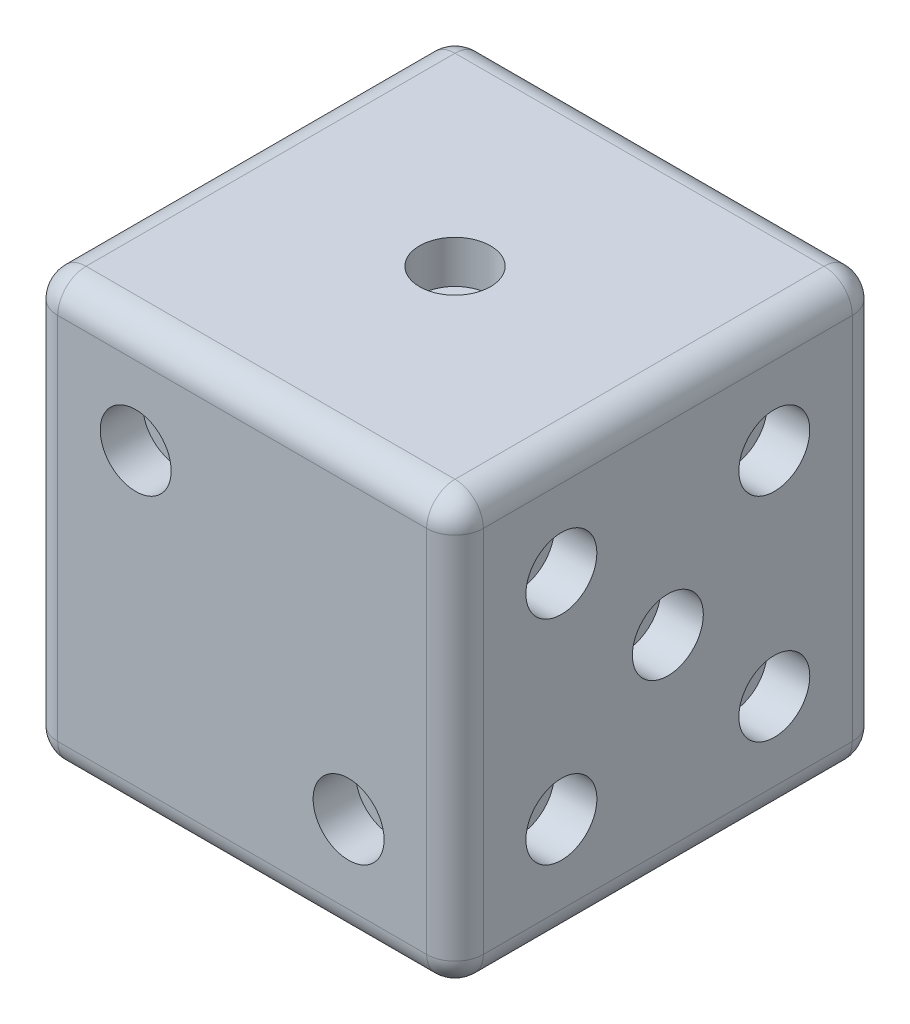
ISO-10303-21;
HEADER;
FILE_DESCRIPTION(('STEP AP214'),'2;1');
FILE_NAME('part.step','',(''),(''),'','','');
FILE_SCHEMA(('AUTOMOTIVE_DESIGN { 1 0 10303 214 1 1 1 1 }'));
ENDSEC;
DATA;
#1=APPLICATION_CONTEXT('core data for automotive mechanical design processes');
#2=APPLICATION_PROTOCOL_DEFINITION('international standard','automotive_design',2000,#1);
#3=PRODUCT_CONTEXT('',#1,'mechanical');
#4=PRODUCT('Part','Part','',(#3));
#5=PRODUCT_RELATED_PRODUCT_CATEGORY('part','',(#4));
#6=PRODUCT_DEFINITION_FORMATION('','',#4);
#7=PRODUCT_DEFINITION_CONTEXT('part definition',#1,'design');
#8=PRODUCT_DEFINITION('design','',#6,#7);
#9=PRODUCT_DEFINITION_SHAPE('','',#8);
#10=(LENGTH_UNIT() NAMED_UNIT(*) SI_UNIT(.MILLI.,.METRE.));
#11=(NAMED_UNIT(*) PLANE_ANGLE_UNIT() SI_UNIT($,.RADIAN.));
#12=(NAMED_UNIT(*) SI_UNIT($,.STERADIAN.) SOLID_ANGLE_UNIT());
#13=UNCERTAINTY_MEASURE_WITH_UNIT(LENGTH_MEASURE(1.E-05),#10,'distance_accuracy_value','');
#14=(GEOMETRIC_REPRESENTATION_CONTEXT(3) GLOBAL_UNCERTAINTY_ASSIGNED_CONTEXT((#13)) GLOBAL_UNIT_ASSIGNED_CONTEXT((#10,
#11,#12)) REPRESENTATION_CONTEXT('',''));
#15=CARTESIAN_POINT('',(0.,0.,0.));
#16=DIRECTION('',(0.,0.,1.));
#17=DIRECTION('',(1.,0.,0.));
#18=AXIS2_PLACEMENT_3D('',#15,#16,#17);
#19=CARTESIAN_POINT('',(30.,30.,0.));
#20=DIRECTION('',(-1.,0.,0.));
#21=DIRECTION('',(0.,0.,1.));
#22=AXIS2_PLACEMENT_3D('',#19,#20,#21);
#23=PLANE('',#22);
#24=CARTESIAN_POINT('',(30.,22.5024029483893,-22.5024029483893));
#25=DIRECTION('',(-1.,0.,0.));
#26=DIRECTION('',(0.,0.,1.));
#27=AXIS2_PLACEMENT_3D('',#24,#25,#26);
#28=CIRCLE('',#27,2.5);
#29=CARTESIAN_POINT('',(30.,22.5024029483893,-20.0024029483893));
#30=VERTEX_POINT('',#29);
#31=EDGE_CURVE('E1109',#30,#30,#28,.T.);
#32=ORIENTED_EDGE('',*,*,#31,.T.);
#33=EDGE_LOOP('',(#32));
#34=FACE_BOUND('',#33,.T.);
#35=DIRECTION('',(0.,-1.,0.));
#36=VECTOR('',#35,1.);
#37=CARTESIAN_POINT('',(30.,30.,-2.));
#38=LINE('',#37,#36);
#39=CARTESIAN_POINT('',(30.,28.,-2.));
#40=VERTEX_POINT('',#39);
#41=CARTESIAN_POINT('',(30.,2.,-2.));
#42=VERTEX_POINT('',#41);
#43=EDGE_CURVE('E191',#40,#42,#38,.T.);
#44=ORIENTED_EDGE('',*,*,#43,.T.);
#45=DIRECTION('',(0.,0.,-1.));
#46=VECTOR('',#45,1.);
#47=CARTESIAN_POINT('',(30.,2.,-28.));
#48=LINE('',#47,#46);
#49=CARTESIAN_POINT('',(30.,2.,-28.));
#50=VERTEX_POINT('',#49);
#51=EDGE_CURVE('E236',#42,#50,#48,.T.);
#52=ORIENTED_EDGE('',*,*,#51,.T.);
#53=DIRECTION('',(0.,-1.,0.));
#54=VECTOR('',#53,1.);
#55=CARTESIAN_POINT('',(30.,30.,-28.));
#56=LINE('',#55,#54);
#57=CARTESIAN_POINT('',(30.,28.,-28.));
#58=VERTEX_POINT('',#57);
#59=EDGE_CURVE('E187',#50,#58,#56,.F.);
#60=ORIENTED_EDGE('',*,*,#59,.T.);
#61=DIRECTION('',(0.,0.,-1.));
#62=VECTOR('',#61,1.);
#63=CARTESIAN_POINT('',(30.,28.,0.));
#64=LINE('',#63,#62);
#65=EDGE_CURVE('E189',#58,#40,#64,.F.);
#66=ORIENTED_EDGE('',*,*,#65,.T.);
#67=EDGE_LOOP('',(#44,#52,#60,#66));
#68=FACE_BOUND('',#67,.T.);
#69=CARTESIAN_POINT('',(30.,7.49759705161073,-22.5024029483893));
#70=DIRECTION('',(1.,0.,0.));
#71=DIRECTION('',(0.,0.,-1.));
#72=AXIS2_PLACEMENT_3D('',#69,#70,#71);
#73=CIRCLE('',#72,2.5);
#74=CARTESIAN_POINT('',(30.,7.49759705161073,-25.0024029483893));
#75=VERTEX_POINT('',#74);
#76=EDGE_CURVE('E1111',#75,#75,#73,.T.);
#77=ORIENTED_EDGE('',*,*,#76,.F.);
#78=EDGE_LOOP('',(#77));
#79=FACE_BOUND('',#78,.T.);
#80=CARTESIAN_POINT('',(30.,22.5024029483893,-7.49759705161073));
#81=DIRECTION('',(1.,0.,0.));
#82=DIRECTION('',(0.,0.,-1.));
#83=AXIS2_PLACEMENT_3D('',#80,#81,#82);
#84=CIRCLE('',#83,2.5);
#85=CARTESIAN_POINT('',(30.,22.5024029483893,-9.99759705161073));
#86=VERTEX_POINT('',#85);
#87=EDGE_CURVE('E1117',#86,#86,#84,.T.);
#88=ORIENTED_EDGE('',*,*,#87,.F.);
#89=EDGE_LOOP('',(#88));
#90=FACE_BOUND('',#89,.T.);
#91=CARTESIAN_POINT('',(30.,15.,-15.));
#92=DIRECTION('',(1.,0.,0.));
#93=DIRECTION('',(0.,0.,-1.));
#94=AXIS2_PLACEMENT_3D('',#91,#92,#93);
#95=CIRCLE('',#94,2.5);
#96=CARTESIAN_POINT('',(30.,15.,-17.5));
#97=VERTEX_POINT('',#96);
#98=EDGE_CURVE('E1123',#97,#97,#95,.T.);
#99=ORIENTED_EDGE('',*,*,#98,.F.);
#100=EDGE_LOOP('',(#99));
#101=FACE_BOUND('',#100,.T.);
#102=CARTESIAN_POINT('',(30.,7.49759705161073,-7.49759705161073));
#103=DIRECTION('',(-1.,0.,0.));
#104=DIRECTION('',(0.,0.,1.));
#105=AXIS2_PLACEMENT_3D('',#102,#103,#104);
#106=CIRCLE('',#105,2.5);
#107=CARTESIAN_POINT('',(30.,7.49759705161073,-4.99759705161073));
#108=VERTEX_POINT('',#107);
#109=EDGE_CURVE('E1129',#108,#108,#106,.T.);
#110=ORIENTED_EDGE('',*,*,#109,.T.);
#111=EDGE_LOOP('',(#110));
#112=FACE_BOUND('',#111,.T.);
#113=ADVANCED_FACE('F35',(#34,#68,#79,#90,#101,#112),#23,.F.);
#114=CARTESIAN_POINT('',(0.,30.,0.));
#115=DIRECTION('',(-1.,0.,0.));
#116=DIRECTION('',(0.,0.,1.));
#117=AXIS2_PLACEMENT_3D('',#114,#115,#116);
#118=PLANE('',#117);
#119=CARTESIAN_POINT('',(0.,22.5024029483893,-7.49759705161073));
#120=DIRECTION('',(1.,0.,0.));
#121=DIRECTION('',(0.,0.,-1.));
#122=AXIS2_PLACEMENT_3D('',#119,#120,#121);
#123=CIRCLE('',#122,2.5);
#124=CARTESIAN_POINT('',(0.,22.5024029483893,-9.99759705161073));
#125=VERTEX_POINT('',#124);
#126=EDGE_CURVE('E995',#125,#125,#123,.T.);
#127=ORIENTED_EDGE('',*,*,#126,.T.);
#128=EDGE_LOOP('',(#127));
#129=FACE_BOUND('',#128,.T.);
#130=CARTESIAN_POINT('',(0.,22.5024029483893,-22.5024029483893));
#131=DIRECTION('',(-1.,0.,0.));
#132=DIRECTION('',(0.,0.,1.));
#133=AXIS2_PLACEMENT_3D('',#130,#131,#132);
#134=CIRCLE('',#133,2.5);
#135=CARTESIAN_POINT('',(0.,22.5024029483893,-20.0024029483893));
#136=VERTEX_POINT('',#135);
#137=EDGE_CURVE('E998',#136,#136,#134,.T.);
#138=ORIENTED_EDGE('',*,*,#137,.F.);
#139=EDGE_LOOP('',(#138));
#140=FACE_BOUND('',#139,.T.);
#141=DIRECTION('',(0.,-1.,0.));
#142=VECTOR('',#141,1.);
#143=CARTESIAN_POINT('',(0.,30.,-28.));
#144=LINE('',#143,#142);
#145=CARTESIAN_POINT('',(0.,28.,-28.));
#146=VERTEX_POINT('',#145);
#147=CARTESIAN_POINT('',(0.,2.,-28.));
#148=VERTEX_POINT('',#147);
#149=EDGE_CURVE('E161',#146,#148,#144,.T.);
#150=ORIENTED_EDGE('',*,*,#149,.T.);
#151=DIRECTION('',(0.,0.,-1.));
#152=VECTOR('',#151,1.);
#153=CARTESIAN_POINT('',(0.,2.,0.));
#154=LINE('',#153,#152);
#155=CARTESIAN_POINT('',(0.,2.,-2.));
#156=VERTEX_POINT('',#155);
#157=EDGE_CURVE('E11',#148,#156,#154,.F.);
#158=ORIENTED_EDGE('',*,*,#157,.T.);
#159=DIRECTION('',(0.,-1.,0.));
#160=VECTOR('',#159,1.);
#161=CARTESIAN_POINT('',(0.,30.,-2.));
#162=LINE('',#161,#160);
#163=CARTESIAN_POINT('',(0.,28.,-2.));
#164=VERTEX_POINT('',#163);
#165=EDGE_CURVE('E123',#156,#164,#162,.F.);
#166=ORIENTED_EDGE('',*,*,#165,.T.);
#167=DIRECTION('',(0.,0.,-1.));
#168=VECTOR('',#167,1.);
#169=CARTESIAN_POINT('',(0.,28.,-30.));
#170=LINE('',#169,#168);
#171=EDGE_CURVE('E129',#164,#146,#170,.T.);
#172=ORIENTED_EDGE('',*,*,#171,.T.);
#173=EDGE_LOOP('',(#150,#158,#166,#172));
#174=FACE_BOUND('',#173,.T.);
#175=CARTESIAN_POINT('',(0.,7.49759705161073,-7.49759705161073));
#176=DIRECTION('',(-1.,0.,0.));
#177=DIRECTION('',(0.,0.,1.));
#178=AXIS2_PLACEMENT_3D('',#175,#176,#177);
#179=CIRCLE('',#178,2.5);
#180=CARTESIAN_POINT('',(0.,7.49759705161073,-4.99759705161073));
#181=VERTEX_POINT('',#180);
#182=EDGE_CURVE('E989',#181,#181,#179,.T.);
#183=ORIENTED_EDGE('',*,*,#182,.F.);
#184=EDGE_LOOP('',(#183));
#185=FACE_BOUND('',#184,.T.);
#186=CARTESIAN_POINT('',(0.,7.49759705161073,-22.5024029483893));
#187=DIRECTION('',(1.,0.,0.));
#188=DIRECTION('',(0.,0.,-1.));
#189=AXIS2_PLACEMENT_3D('',#186,#187,#188);
#190=CIRCLE('',#189,2.5);
#191=CARTESIAN_POINT('',(0.,7.49759705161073,-25.0024029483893));
#192=VERTEX_POINT('',#191);
#193=EDGE_CURVE('E983',#192,#192,#190,.T.);
#194=ORIENTED_EDGE('',*,*,#193,.T.);
#195=EDGE_LOOP('',(#194));
#196=FACE_BOUND('',#195,.T.);
#197=ADVANCED_FACE('F126',(#129,#140,#174,#185,#196),#118,.T.);
#198=CARTESIAN_POINT('',(0.,0.,0.));
#199=DIRECTION('',(0.,-1.,0.));
#200=DIRECTION('',(0.,0.,-1.));
#201=AXIS2_PLACEMENT_3D('',#198,#199,#200);
#202=PLANE('',#201);
#203=DIRECTION('',(0.,0.,-1.));
#204=VECTOR('',#203,1.);
#205=CARTESIAN_POINT('',(2.,0.,0.));
#206=LINE('',#205,#204);
#207=CARTESIAN_POINT('',(2.,0.,-2.));
#208=VERTEX_POINT('',#207);
#209=CARTESIAN_POINT('',(1.99999999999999,0.,-28.));
#210=VERTEX_POINT('',#209);
#211=EDGE_CURVE('E227',#208,#210,#206,.T.);
#212=ORIENTED_EDGE('',*,*,#211,.T.);
#213=DIRECTION('',(1.,0.,0.));
#214=VECTOR('',#213,1.);
#215=CARTESIAN_POINT('',(0.,0.,-28.));
#216=LINE('',#215,#214);
#217=CARTESIAN_POINT('',(28.,0.,-28.));
#218=VERTEX_POINT('',#217);
#219=EDGE_CURVE('E232',#210,#218,#216,.T.);
#220=ORIENTED_EDGE('',*,*,#219,.T.);
#221=DIRECTION('',(0.,0.,-1.));
#222=VECTOR('',#221,1.);
#223=CARTESIAN_POINT('',(28.,0.,-2.));
#224=LINE('',#223,#222);
#225=CARTESIAN_POINT('',(28.,0.,-2.));
#226=VERTEX_POINT('',#225);
#227=EDGE_CURVE('E52',#218,#226,#224,.F.);
#228=ORIENTED_EDGE('',*,*,#227,.T.);
#229=DIRECTION('',(1.,0.,0.));
#230=VECTOR('',#229,1.);
#231=CARTESIAN_POINT('',(2.,0.,-2.));
#232=LINE('',#231,#230);
#233=EDGE_CURVE('E229',#226,#208,#232,.F.);
#234=ORIENTED_EDGE('',*,*,#233,.T.);
#235=EDGE_LOOP('',(#212,#220,#228,#234));
#236=FACE_BOUND('',#235,.T.);
#237=CARTESIAN_POINT('',(22.5,0.,-22.5));
#238=DIRECTION('',(0.,-1.,0.));
#239=DIRECTION('',(0.,0.,-1.));
#240=AXIS2_PLACEMENT_3D('',#237,#238,#239);
#241=CIRCLE('',#240,2.5);
#242=CARTESIAN_POINT('',(22.5,0.,-25.));
#243=VERTEX_POINT('',#242);
#244=EDGE_CURVE('E1025',#243,#243,#241,.T.);
#245=ORIENTED_EDGE('',*,*,#244,.F.);
#246=EDGE_LOOP('',(#245));
#247=FACE_BOUND('',#246,.T.);
#248=CARTESIAN_POINT('',(22.5,0.,-15.));
#249=DIRECTION('',(0.,-1.,0.));
#250=DIRECTION('',(0.,0.,-1.));
#251=AXIS2_PLACEMENT_3D('',#248,#249,#250);
#252=CIRCLE('',#251,2.5);
#253=CARTESIAN_POINT('',(22.5,0.,-17.5));
#254=VERTEX_POINT('',#253);
#255=EDGE_CURVE('E1031',#254,#254,#252,.T.);
#256=ORIENTED_EDGE('',*,*,#255,.F.);
#257=EDGE_LOOP('',(#256));
#258=FACE_BOUND('',#257,.T.);
#259=CARTESIAN_POINT('',(7.5,0.,-15.));
#260=DIRECTION('',(0.,1.,0.));
#261=DIRECTION('',(0.,0.,1.));
#262=AXIS2_PLACEMENT_3D('',#259,#260,#261);
#263=CIRCLE('',#262,2.5);
#264=CARTESIAN_POINT('',(7.5,0.,-12.5));
#265=VERTEX_POINT('',#264);
#266=EDGE_CURVE('E1049',#265,#265,#263,.T.);
#267=ORIENTED_EDGE('',*,*,#266,.T.);
#268=EDGE_LOOP('',(#267));
#269=FACE_BOUND('',#268,.T.);
#270=CARTESIAN_POINT('',(7.5,0.,-22.5));
#271=DIRECTION('',(0.,1.,0.));
#272=DIRECTION('',(0.,0.,1.));
#273=AXIS2_PLACEMENT_3D('',#270,#271,#272);
#274=CIRCLE('',#273,2.5);
#275=CARTESIAN_POINT('',(7.5,0.,-20.));
#276=VERTEX_POINT('',#275);
#277=EDGE_CURVE('E1052',#276,#276,#274,.T.);
#278=ORIENTED_EDGE('',*,*,#277,.T.);
#279=EDGE_LOOP('',(#278));
#280=FACE_BOUND('',#279,.T.);
#281=CARTESIAN_POINT('',(7.5,0.,-7.50000000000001));
#282=DIRECTION('',(0.,-1.,0.));
#283=DIRECTION('',(0.,0.,-1.));
#284=AXIS2_PLACEMENT_3D('',#281,#282,#283);
#285=CIRCLE('',#284,2.5);
#286=CARTESIAN_POINT('',(7.5,0.,-10.));
#287=VERTEX_POINT('',#286);
#288=EDGE_CURVE('E1043',#287,#287,#285,.T.);
#289=ORIENTED_EDGE('',*,*,#288,.F.);
#290=EDGE_LOOP('',(#289));
#291=FACE_BOUND('',#290,.T.);
#292=CARTESIAN_POINT('',(22.5,0.,-7.50000000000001));
#293=DIRECTION('',(0.,1.,0.));
#294=DIRECTION('',(0.,0.,1.));
#295=AXIS2_PLACEMENT_3D('',#292,#293,#294);
#296=CIRCLE('',#295,2.5);
#297=CARTESIAN_POINT('',(22.5,0.,-5.00000000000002));
#298=VERTEX_POINT('',#297);
#299=EDGE_CURVE('E1037',#298,#298,#296,.T.);
#300=ORIENTED_EDGE('',*,*,#299,.T.);
#301=EDGE_LOOP('',(#300));
#302=FACE_BOUND('',#301,.T.);
#303=ADVANCED_FACE('F330',(#236,#247,#258,#269,#280,#291,#302),#202,.T.);
#304=CARTESIAN_POINT('',(0.,30.,0.));
#305=DIRECTION('',(0.,0.,-1.));
#306=DIRECTION('',(-1.,0.,0.));
#307=AXIS2_PLACEMENT_3D('',#304,#305,#306);
#308=PLANE('',#307);
#309=CARTESIAN_POINT('',(22.5024029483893,7.49759705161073,0.));
#310=DIRECTION('',(0.,0.,1.));
#311=DIRECTION('',(1.,0.,0.));
#312=AXIS2_PLACEMENT_3D('',#309,#310,#311);
#313=CIRCLE('',#312,2.5);
#314=CARTESIAN_POINT('',(25.0024029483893,7.49759705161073,0.));
#315=VERTEX_POINT('',#314);
#316=EDGE_CURVE('E969',#315,#315,#313,.T.);
#317=ORIENTED_EDGE('',*,*,#316,.F.);
#318=EDGE_LOOP('',(#317));
#319=FACE_BOUND('',#318,.T.);
#320=CARTESIAN_POINT('',(7.49759705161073,22.5024029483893,0.));
#321=DIRECTION('',(0.,0.,1.));
#322=DIRECTION('',(1.,0.,0.));
#323=AXIS2_PLACEMENT_3D('',#320,#321,#322);
#324=CIRCLE('',#323,2.5);
#325=CARTESIAN_POINT('',(9.99759705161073,22.5024029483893,0.));
#326=VERTEX_POINT('',#325);
#327=EDGE_CURVE('E972',#326,#326,#324,.T.);
#328=ORIENTED_EDGE('',*,*,#327,.F.);
#329=EDGE_LOOP('',(#328));
#330=FACE_BOUND('',#329,.T.);
#331=DIRECTION('',(0.,-1.,0.));
#332=VECTOR('',#331,1.);
#333=CARTESIAN_POINT('',(2.,0.,0.));
#334=LINE('',#333,#332);
#335=CARTESIAN_POINT('',(2.,28.,0.));
#336=VERTEX_POINT('',#335);
#337=CARTESIAN_POINT('',(2.,2.,0.));
#338=VERTEX_POINT('',#337);
#339=EDGE_CURVE('E143',#336,#338,#334,.T.);
#340=ORIENTED_EDGE('',*,*,#339,.T.);
#341=DIRECTION('',(1.,0.,0.));
#342=VECTOR('',#341,1.);
#343=CARTESIAN_POINT('',(28.,2.,0.));
#344=LINE('',#343,#342);
#345=CARTESIAN_POINT('',(28.,2.,0.));
#346=VERTEX_POINT('',#345);
#347=EDGE_CURVE('E44',#338,#346,#344,.T.);
#348=ORIENTED_EDGE('',*,*,#347,.T.);
#349=DIRECTION('',(0.,-1.,0.));
#350=VECTOR('',#349,1.);
#351=CARTESIAN_POINT('',(28.,30.,0.));
#352=LINE('',#351,#350);
#353=CARTESIAN_POINT('',(28.,28.,0.));
#354=VERTEX_POINT('',#353);
#355=EDGE_CURVE('E182',#346,#354,#352,.F.);
#356=ORIENTED_EDGE('',*,*,#355,.T.);
#357=DIRECTION('',(1.,0.,0.));
#358=VECTOR('',#357,1.);
#359=CARTESIAN_POINT('',(0.,28.,0.));
#360=LINE('',#359,#358);
#361=EDGE_CURVE('E184',#354,#336,#360,.F.);
#362=ORIENTED_EDGE('',*,*,#361,.T.);
#363=EDGE_LOOP('',(#340,#348,#356,#362));
#364=FACE_BOUND('',#363,.T.);
#365=ADVANCED_FACE('F298',(#319,#330,#364),#308,.F.);
#366=CARTESIAN_POINT('',(0.,30.,-30.));
#367=DIRECTION('',(0.,0.,-1.));
#368=DIRECTION('',(-1.,0.,0.));
#369=AXIS2_PLACEMENT_3D('',#366,#367,#368);
#370=PLANE('',#369);
#371=CARTESIAN_POINT('',(7.49759705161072,22.5024029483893,-30.));
#372=DIRECTION('',(0.,0.,-1.));
#373=DIRECTION('',(-1.,0.,0.));
#374=AXIS2_PLACEMENT_3D('',#371,#372,#373);
#375=CIRCLE('',#374,2.5);
#376=CARTESIAN_POINT('',(4.99759705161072,22.5024029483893,-30.));
#377=VERTEX_POINT('',#376);
#378=EDGE_CURVE('E1007',#377,#377,#375,.T.);
#379=ORIENTED_EDGE('',*,*,#378,.F.);
#380=EDGE_LOOP('',(#379));
#381=FACE_BOUND('',#380,.T.);
#382=CARTESIAN_POINT('',(15.,15.,-30.));
#383=DIRECTION('',(0.,0.,-1.));
#384=DIRECTION('',(-1.,0.,0.));
#385=AXIS2_PLACEMENT_3D('',#382,#383,#384);
#386=CIRCLE('',#385,2.5);
#387=CARTESIAN_POINT('',(12.5,15.,-30.));
#388=VERTEX_POINT('',#387);
#389=EDGE_CURVE('E1013',#388,#388,#386,.T.);
#390=ORIENTED_EDGE('',*,*,#389,.F.);
#391=EDGE_LOOP('',(#390));
#392=FACE_BOUND('',#391,.T.);
#393=CARTESIAN_POINT('',(22.5024029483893,7.49759705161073,-30.));
#394=DIRECTION('',(0.,0.,-1.));
#395=DIRECTION('',(-1.,0.,0.));
#396=AXIS2_PLACEMENT_3D('',#393,#394,#395);
#397=CIRCLE('',#396,2.5);
#398=CARTESIAN_POINT('',(20.0024029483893,7.49759705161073,-30.));
#399=VERTEX_POINT('',#398);
#400=EDGE_CURVE('E1016',#399,#399,#397,.T.);
#401=ORIENTED_EDGE('',*,*,#400,.F.);
#402=EDGE_LOOP('',(#401));
#403=FACE_BOUND('',#402,.T.);
#404=DIRECTION('',(0.,-1.,0.));
#405=VECTOR('',#404,1.);
#406=CARTESIAN_POINT('',(28.,0.,-30.));
#407=LINE('',#406,#405);
#408=CARTESIAN_POINT('',(28.,28.,-30.));
#409=VERTEX_POINT('',#408);
#410=CARTESIAN_POINT('',(28.,2.,-30.));
#411=VERTEX_POINT('',#410);
#412=EDGE_CURVE('E163',#409,#411,#407,.T.);
#413=ORIENTED_EDGE('',*,*,#412,.T.);
#414=DIRECTION('',(1.,0.,0.));
#415=VECTOR('',#414,1.);
#416=CARTESIAN_POINT('',(0.,2.,-30.));
#417=LINE('',#416,#415);
#418=CARTESIAN_POINT('',(1.99999999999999,2.,-30.));
#419=VERTEX_POINT('',#418);
#420=EDGE_CURVE('E234',#411,#419,#417,.F.);
#421=ORIENTED_EDGE('',*,*,#420,.T.);
#422=DIRECTION('',(0.,-1.,0.));
#423=VECTOR('',#422,1.);
#424=CARTESIAN_POINT('',(1.99999999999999,30.,-30.));
#425=LINE('',#424,#423);
#426=CARTESIAN_POINT('',(1.99999999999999,28.,-30.));
#427=VERTEX_POINT('',#426);
#428=EDGE_CURVE('E171',#419,#427,#425,.F.);
#429=ORIENTED_EDGE('',*,*,#428,.T.);
#430=DIRECTION('',(1.,0.,0.));
#431=VECTOR('',#430,1.);
#432=CARTESIAN_POINT('',(30.,28.,-30.));
#433=LINE('',#432,#431);
#434=EDGE_CURVE('E169',#427,#409,#433,.T.);
#435=ORIENTED_EDGE('',*,*,#434,.T.);
#436=EDGE_LOOP('',(#413,#421,#429,#435));
#437=FACE_BOUND('',#436,.T.);
#438=ADVANCED_FACE('F271',(#381,#392,#403,#437),#370,.T.);
#439=CARTESIAN_POINT('',(0.,30.,0.));
#440=DIRECTION('',(0.,-1.,0.));
#441=DIRECTION('',(0.,0.,-1.));
#442=AXIS2_PLACEMENT_3D('',#439,#440,#441);
#443=PLANE('',#442);
#444=DIRECTION('',(1.,0.,0.));
#445=VECTOR('',#444,1.);
#446=CARTESIAN_POINT('',(0.,30.,-28.));
#447=LINE('',#446,#445);
#448=CARTESIAN_POINT('',(28.,30.,-28.));
#449=VERTEX_POINT('',#448);
#450=CARTESIAN_POINT('',(1.99999999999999,30.,-28.));
#451=VERTEX_POINT('',#450);
#452=EDGE_CURVE('E173',#449,#451,#447,.F.);
#453=ORIENTED_EDGE('',*,*,#452,.T.);
#454=DIRECTION('',(0.,0.,-1.));
#455=VECTOR('',#454,1.);
#456=CARTESIAN_POINT('',(2.,30.,0.));
#457=LINE('',#456,#455);
#458=CARTESIAN_POINT('',(2.,30.,-2.));
#459=VERTEX_POINT('',#458);
#460=EDGE_CURVE('E179',#451,#459,#457,.F.);
#461=ORIENTED_EDGE('',*,*,#460,.T.);
#462=DIRECTION('',(1.,0.,0.));
#463=VECTOR('',#462,1.);
#464=CARTESIAN_POINT('',(0.,30.,-2.));
#465=LINE('',#464,#463);
#466=CARTESIAN_POINT('',(28.,30.,-2.));
#467=VERTEX_POINT('',#466);
#468=EDGE_CURVE('E177',#459,#467,#465,.T.);
#469=ORIENTED_EDGE('',*,*,#468,.T.);
#470=DIRECTION('',(0.,0.,-1.));
#471=VECTOR('',#470,1.);
#472=CARTESIAN_POINT('',(28.,30.,0.));
#473=LINE('',#472,#471);
#474=EDGE_CURVE('E175',#467,#449,#473,.T.);
#475=ORIENTED_EDGE('',*,*,#474,.T.);
#476=EDGE_LOOP('',(#453,#461,#469,#475));
#477=FACE_BOUND('',#476,.T.);
#478=CARTESIAN_POINT('',(15.,30.,-15.));
#479=DIRECTION('',(0.,1.,0.));
#480=DIRECTION('',(0.,0.,1.));
#481=AXIS2_PLACEMENT_3D('',#478,#479,#480);
#482=CIRCLE('',#481,2.5);
#483=CARTESIAN_POINT('',(15.,30.,-12.5));
#484=VERTEX_POINT('',#483);
#485=EDGE_CURVE('E219',#484,#484,#482,.T.);
#486=ORIENTED_EDGE('',*,*,#485,.F.);
#487=EDGE_LOOP('',(#486));
#488=FACE_BOUND('',#487,.T.);
#489=ADVANCED_FACE('F307',(#477,#488),#443,.F.);
#490=CARTESIAN_POINT('',(7.5,3.,-22.5));
#491=DIRECTION('',(0.,-1.,0.));
#492=DIRECTION('',(0.,0.,-1.));
#493=AXIS2_PLACEMENT_3D('',#490,#491,#492);
#494=CYLINDRICAL_SURFACE('',#493,2.5);
#495=CARTESIAN_POINT('',(7.5,3.,-22.5));
#496=DIRECTION('',(0.,1.,0.));
#497=DIRECTION('',(0.,0.,1.));
#498=AXIS2_PLACEMENT_3D('',#495,#496,#497);
#499=CIRCLE('',#498,2.5);
#500=CARTESIAN_POINT('',(7.5,3.,-20.));
#501=VERTEX_POINT('',#500);
#502=EDGE_CURVE('E135',#501,#501,#499,.T.);
#503=ORIENTED_EDGE('',*,*,#502,.T.);
#504=EDGE_LOOP('',(#503));
#505=FACE_BOUND('',#504,.T.);
#506=ORIENTED_EDGE('',*,*,#277,.F.);
#507=EDGE_LOOP('',(#506));
#508=FACE_BOUND('',#507,.T.);
#509=ADVANCED_FACE('F880',(#505,#508),#494,.F.);
#510=CARTESIAN_POINT('',(7.5,3.,-22.5));
#511=DIRECTION('',(0.,1.,0.));
#512=DIRECTION('',(0.,0.,1.));
#513=AXIS2_PLACEMENT_3D('',#510,#511,#512);
#514=PLANE('',#513);
#515=ORIENTED_EDGE('',*,*,#502,.F.);
#516=EDGE_LOOP('',(#515));
#517=FACE_BOUND('',#516,.T.);
#518=ADVANCED_FACE('F871',(#517),#514,.F.);
#519=CARTESIAN_POINT('',(7.5,3.,-15.));
#520=DIRECTION('',(0.,-1.,0.));
#521=DIRECTION('',(0.,0.,-1.));
#522=AXIS2_PLACEMENT_3D('',#519,#520,#521);
#523=CYLINDRICAL_SURFACE('',#522,2.5);
#524=CARTESIAN_POINT('',(7.5,3.,-15.));
#525=DIRECTION('',(0.,1.,0.));
#526=DIRECTION('',(0.,0.,1.));
#527=AXIS2_PLACEMENT_3D('',#524,#525,#526);
#528=CIRCLE('',#527,2.5);
#529=CARTESIAN_POINT('',(7.5,3.,-12.5));
#530=VERTEX_POINT('',#529);
#531=EDGE_CURVE('E1046',#530,#530,#528,.T.);
#532=ORIENTED_EDGE('',*,*,#531,.T.);
#533=EDGE_LOOP('',(#532));
#534=FACE_BOUND('',#533,.T.);
#535=ORIENTED_EDGE('',*,*,#266,.F.);
#536=EDGE_LOOP('',(#535));
#537=FACE_BOUND('',#536,.T.);
#538=ADVANCED_FACE('F862',(#534,#537),#523,.F.);
#539=CARTESIAN_POINT('',(7.5,3.,-15.));
#540=DIRECTION('',(0.,1.,0.));
#541=DIRECTION('',(0.,0.,1.));
#542=AXIS2_PLACEMENT_3D('',#539,#540,#541);
#543=PLANE('',#542);
#544=ORIENTED_EDGE('',*,*,#531,.F.);
#545=EDGE_LOOP('',(#544));
#546=FACE_BOUND('',#545,.T.);
#547=ADVANCED_FACE('F853',(#546),#543,.F.);
#548=CARTESIAN_POINT('',(7.5,3.,-7.50000000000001));
#549=DIRECTION('',(0.,-1.,0.));
#550=DIRECTION('',(0.,0.,-1.));
#551=AXIS2_PLACEMENT_3D('',#548,#549,#550);
#552=CYLINDRICAL_SURFACE('',#551,2.5);
#553=CARTESIAN_POINT('',(7.5,3.,-7.50000000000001));
#554=DIRECTION('',(0.,-1.,0.));
#555=DIRECTION('',(0.,0.,-1.));
#556=AXIS2_PLACEMENT_3D('',#553,#554,#555);
#557=CIRCLE('',#556,2.5);
#558=CARTESIAN_POINT('',(7.5,3.,-10.));
#559=VERTEX_POINT('',#558);
#560=EDGE_CURVE('E1040',#559,#559,#557,.T.);
#561=ORIENTED_EDGE('',*,*,#560,.F.);
#562=EDGE_LOOP('',(#561));
#563=FACE_BOUND('',#562,.T.);
#564=ORIENTED_EDGE('',*,*,#288,.T.);
#565=EDGE_LOOP('',(#564));
#566=FACE_BOUND('',#565,.T.);
#567=ADVANCED_FACE('F844',(#563,#566),#552,.F.);
#568=CARTESIAN_POINT('',(7.5,3.,-7.50000000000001));
#569=DIRECTION('',(0.,-1.,0.));
#570=DIRECTION('',(0.,0.,-1.));
#571=AXIS2_PLACEMENT_3D('',#568,#569,#570);
#572=PLANE('',#571);
#573=ORIENTED_EDGE('',*,*,#560,.T.);
#574=EDGE_LOOP('',(#573));
#575=FACE_BOUND('',#574,.T.);
#576=ADVANCED_FACE('F835',(#575),#572,.T.);
#577=CARTESIAN_POINT('',(22.5,3.,-7.50000000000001));
#578=DIRECTION('',(0.,-1.,0.));
#579=DIRECTION('',(0.,0.,-1.));
#580=AXIS2_PLACEMENT_3D('',#577,#578,#579);
#581=CYLINDRICAL_SURFACE('',#580,2.5);
#582=CARTESIAN_POINT('',(22.5,3.,-7.50000000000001));
#583=DIRECTION('',(0.,1.,0.));
#584=DIRECTION('',(0.,0.,1.));
#585=AXIS2_PLACEMENT_3D('',#582,#583,#584);
#586=CIRCLE('',#585,2.5);
#587=CARTESIAN_POINT('',(22.5,3.,-5.00000000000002));
#588=VERTEX_POINT('',#587);
#589=EDGE_CURVE('E1034',#588,#588,#586,.T.);
#590=ORIENTED_EDGE('',*,*,#589,.T.);
#591=EDGE_LOOP('',(#590));
#592=FACE_BOUND('',#591,.T.);
#593=ORIENTED_EDGE('',*,*,#299,.F.);
#594=EDGE_LOOP('',(#593));
#595=FACE_BOUND('',#594,.T.);
#596=ADVANCED_FACE('F826',(#592,#595),#581,.F.);
#597=CARTESIAN_POINT('',(22.5,3.,-7.50000000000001));
#598=DIRECTION('',(0.,1.,0.));
#599=DIRECTION('',(0.,0.,1.));
#600=AXIS2_PLACEMENT_3D('',#597,#598,#599);
#601=PLANE('',#600);
#602=ORIENTED_EDGE('',*,*,#589,.F.);
#603=EDGE_LOOP('',(#602));
#604=FACE_BOUND('',#603,.T.);
#605=ADVANCED_FACE('F817',(#604),#601,.F.);
#606=CARTESIAN_POINT('',(22.5,3.,-15.));
#607=DIRECTION('',(0.,-1.,0.));
#608=DIRECTION('',(0.,0.,-1.));
#609=AXIS2_PLACEMENT_3D('',#606,#607,#608);
#610=CYLINDRICAL_SURFACE('',#609,2.5);
#611=CARTESIAN_POINT('',(22.5,3.,-15.));
#612=DIRECTION('',(0.,-1.,0.));
#613=DIRECTION('',(0.,0.,-1.));
#614=AXIS2_PLACEMENT_3D('',#611,#612,#613);
#615=CIRCLE('',#614,2.5);
#616=CARTESIAN_POINT('',(22.5,3.,-17.5));
#617=VERTEX_POINT('',#616);
#618=EDGE_CURVE('E1028',#617,#617,#615,.T.);
#619=ORIENTED_EDGE('',*,*,#618,.F.);
#620=EDGE_LOOP('',(#619));
#621=FACE_BOUND('',#620,.T.);
#622=ORIENTED_EDGE('',*,*,#255,.T.);
#623=EDGE_LOOP('',(#622));
#624=FACE_BOUND('',#623,.T.);
#625=ADVANCED_FACE('F808',(#621,#624),#610,.F.);
#626=CARTESIAN_POINT('',(22.5,3.,-15.));
#627=DIRECTION('',(0.,-1.,0.));
#628=DIRECTION('',(0.,0.,-1.));
#629=AXIS2_PLACEMENT_3D('',#626,#627,#628);
#630=PLANE('',#629);
#631=ORIENTED_EDGE('',*,*,#618,.T.);
#632=EDGE_LOOP('',(#631));
#633=FACE_BOUND('',#632,.T.);
#634=ADVANCED_FACE('F799',(#633),#630,.T.);
#635=CARTESIAN_POINT('',(22.5,3.,-22.5));
#636=DIRECTION('',(0.,-1.,0.));
#637=DIRECTION('',(0.,0.,-1.));
#638=AXIS2_PLACEMENT_3D('',#635,#636,#637);
#639=CYLINDRICAL_SURFACE('',#638,2.5);
#640=CARTESIAN_POINT('',(22.5,3.,-22.5));
#641=DIRECTION('',(0.,-1.,0.));
#642=DIRECTION('',(0.,0.,-1.));
#643=AXIS2_PLACEMENT_3D('',#640,#641,#642);
#644=CIRCLE('',#643,2.5);
#645=CARTESIAN_POINT('',(22.5,3.,-25.));
#646=VERTEX_POINT('',#645);
#647=EDGE_CURVE('E1022',#646,#646,#644,.T.);
#648=ORIENTED_EDGE('',*,*,#647,.F.);
#649=EDGE_LOOP('',(#648));
#650=FACE_BOUND('',#649,.T.);
#651=ORIENTED_EDGE('',*,*,#244,.T.);
#652=EDGE_LOOP('',(#651));
#653=FACE_BOUND('',#652,.T.);
#654=ADVANCED_FACE('F790',(#650,#653),#639,.F.);
#655=CARTESIAN_POINT('',(22.5,3.,-22.5));
#656=DIRECTION('',(0.,-1.,0.));
#657=DIRECTION('',(0.,0.,-1.));
#658=AXIS2_PLACEMENT_3D('',#655,#656,#657);
#659=PLANE('',#658);
#660=ORIENTED_EDGE('',*,*,#647,.T.);
#661=EDGE_LOOP('',(#660));
#662=FACE_BOUND('',#661,.T.);
#663=ADVANCED_FACE('F781',(#662),#659,.T.);
#664=CARTESIAN_POINT('',(22.5024029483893,7.49759705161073,-27.));
#665=DIRECTION('',(0.,0.,-1.));
#666=DIRECTION('',(-1.,0.,0.));
#667=AXIS2_PLACEMENT_3D('',#664,#665,#666);
#668=CYLINDRICAL_SURFACE('',#667,2.5);
#669=CARTESIAN_POINT('',(22.5024029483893,7.49759705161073,-27.));
#670=DIRECTION('',(0.,0.,-1.));
#671=DIRECTION('',(-1.,0.,0.));
#672=AXIS2_PLACEMENT_3D('',#669,#670,#671);
#673=CIRCLE('',#672,2.5);
#674=CARTESIAN_POINT('',(20.0024029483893,7.49759705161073,-27.));
#675=VERTEX_POINT('',#674);
#676=EDGE_CURVE('E1019',#675,#675,#673,.T.);
#677=ORIENTED_EDGE('',*,*,#676,.F.);
#678=EDGE_LOOP('',(#677));
#679=FACE_BOUND('',#678,.T.);
#680=ORIENTED_EDGE('',*,*,#400,.T.);
#681=EDGE_LOOP('',(#680));
#682=FACE_BOUND('',#681,.T.);
#683=ADVANCED_FACE('F772',(#679,#682),#668,.F.);
#684=CARTESIAN_POINT('',(22.5024029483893,7.49759705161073,-27.));
#685=DIRECTION('',(0.,0.,-1.));
#686=DIRECTION('',(-1.,0.,0.));
#687=AXIS2_PLACEMENT_3D('',#684,#685,#686);
#688=PLANE('',#687);
#689=ORIENTED_EDGE('',*,*,#676,.T.);
#690=EDGE_LOOP('',(#689));
#691=FACE_BOUND('',#690,.T.);
#692=ADVANCED_FACE('F763',(#691),#688,.T.);
#693=CARTESIAN_POINT('',(15.,15.,-27.));
#694=DIRECTION('',(0.,0.,-1.));
#695=DIRECTION('',(-1.,0.,0.));
#696=AXIS2_PLACEMENT_3D('',#693,#694,#695);
#697=CYLINDRICAL_SURFACE('',#696,2.5);
#698=CARTESIAN_POINT('',(15.,15.,-27.));
#699=DIRECTION('',(0.,0.,-1.));
#700=DIRECTION('',(-1.,0.,0.));
#701=AXIS2_PLACEMENT_3D('',#698,#699,#700);
#702=CIRCLE('',#701,2.5);
#703=CARTESIAN_POINT('',(12.5,15.,-27.));
#704=VERTEX_POINT('',#703);
#705=EDGE_CURVE('E1010',#704,#704,#702,.T.);
#706=ORIENTED_EDGE('',*,*,#705,.F.);
#707=EDGE_LOOP('',(#706));
#708=FACE_BOUND('',#707,.T.);
#709=ORIENTED_EDGE('',*,*,#389,.T.);
#710=EDGE_LOOP('',(#709));
#711=FACE_BOUND('',#710,.T.);
#712=ADVANCED_FACE('F754',(#708,#711),#697,.F.);
#713=CARTESIAN_POINT('',(15.,15.,-27.));
#714=DIRECTION('',(0.,0.,-1.));
#715=DIRECTION('',(-1.,0.,0.));
#716=AXIS2_PLACEMENT_3D('',#713,#714,#715);
#717=PLANE('',#716);
#718=ORIENTED_EDGE('',*,*,#705,.T.);
#719=EDGE_LOOP('',(#718));
#720=FACE_BOUND('',#719,.T.);
#721=ADVANCED_FACE('F745',(#720),#717,.T.);
#722=CARTESIAN_POINT('',(7.49759705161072,22.5024029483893,-27.));
#723=DIRECTION('',(0.,0.,-1.));
#724=DIRECTION('',(-1.,0.,0.));
#725=AXIS2_PLACEMENT_3D('',#722,#723,#724);
#726=CYLINDRICAL_SURFACE('',#725,2.5);
#727=CARTESIAN_POINT('',(7.49759705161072,22.5024029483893,-27.));
#728=DIRECTION('',(0.,0.,-1.));
#729=DIRECTION('',(-1.,0.,0.));
#730=AXIS2_PLACEMENT_3D('',#727,#728,#729);
#731=CIRCLE('',#730,2.5);
#732=CARTESIAN_POINT('',(4.99759705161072,22.5024029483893,-27.));
#733=VERTEX_POINT('',#732);
#734=EDGE_CURVE('E1004',#733,#733,#731,.T.);
#735=ORIENTED_EDGE('',*,*,#734,.F.);
#736=EDGE_LOOP('',(#735));
#737=FACE_BOUND('',#736,.T.);
#738=ORIENTED_EDGE('',*,*,#378,.T.);
#739=EDGE_LOOP('',(#738));
#740=FACE_BOUND('',#739,.T.);
#741=ADVANCED_FACE('F736',(#737,#740),#726,.F.);
#742=CARTESIAN_POINT('',(7.49759705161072,22.5024029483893,-27.));
#743=DIRECTION('',(0.,0.,-1.));
#744=DIRECTION('',(-1.,0.,0.));
#745=AXIS2_PLACEMENT_3D('',#742,#743,#744);
#746=PLANE('',#745);
#747=ORIENTED_EDGE('',*,*,#734,.T.);
#748=EDGE_LOOP('',(#747));
#749=FACE_BOUND('',#748,.T.);
#750=ADVANCED_FACE('F722',(#749),#746,.T.);
#751=CARTESIAN_POINT('',(2.99999999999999,22.5024029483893,-22.5024029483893));
#752=DIRECTION('',(-1.,0.,0.));
#753=DIRECTION('',(0.,0.,1.));
#754=AXIS2_PLACEMENT_3D('',#751,#752,#753);
#755=CYLINDRICAL_SURFACE('',#754,2.5);
#756=CARTESIAN_POINT('',(2.99999999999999,22.5024029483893,-22.5024029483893));
#757=DIRECTION('',(-1.,0.,0.));
#758=DIRECTION('',(0.,0.,1.));
#759=AXIS2_PLACEMENT_3D('',#756,#757,#758);
#760=CIRCLE('',#759,2.5);
#761=CARTESIAN_POINT('',(2.99999999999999,22.5024029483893,-20.0024029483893));
#762=VERTEX_POINT('',#761);
#763=EDGE_CURVE('E1001',#762,#762,#760,.T.);
#764=ORIENTED_EDGE('',*,*,#763,.F.);
#765=EDGE_LOOP('',(#764));
#766=FACE_BOUND('',#765,.T.);
#767=ORIENTED_EDGE('',*,*,#137,.T.);
#768=EDGE_LOOP('',(#767));
#769=FACE_BOUND('',#768,.T.);
#770=ADVANCED_FACE('F713',(#766,#769),#755,.F.);
#771=CARTESIAN_POINT('',(2.99999999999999,22.5024029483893,-22.5024029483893));
#772=DIRECTION('',(-1.,0.,0.));
#773=DIRECTION('',(0.,0.,1.));
#774=AXIS2_PLACEMENT_3D('',#771,#772,#773);
#775=PLANE('',#774);
#776=ORIENTED_EDGE('',*,*,#763,.T.);
#777=EDGE_LOOP('',(#776));
#778=FACE_BOUND('',#777,.T.);
#779=ADVANCED_FACE('F704',(#778),#775,.T.);
#780=CARTESIAN_POINT('',(3.,22.5024029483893,-7.49759705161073));
#781=DIRECTION('',(-1.,0.,0.));
#782=DIRECTION('',(0.,0.,1.));
#783=AXIS2_PLACEMENT_3D('',#780,#781,#782);
#784=CYLINDRICAL_SURFACE('',#783,2.5);
#785=CARTESIAN_POINT('',(3.,22.5024029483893,-7.49759705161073));
#786=DIRECTION('',(1.,0.,0.));
#787=DIRECTION('',(0.,0.,-1.));
#788=AXIS2_PLACEMENT_3D('',#785,#786,#787);
#789=CIRCLE('',#788,2.5);
#790=CARTESIAN_POINT('',(3.,22.5024029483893,-9.99759705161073));
#791=VERTEX_POINT('',#790);
#792=EDGE_CURVE('E992',#791,#791,#789,.T.);
#793=ORIENTED_EDGE('',*,*,#792,.T.);
#794=EDGE_LOOP('',(#793));
#795=FACE_BOUND('',#794,.T.);
#796=ORIENTED_EDGE('',*,*,#126,.F.);
#797=EDGE_LOOP('',(#796));
#798=FACE_BOUND('',#797,.T.);
#799=ADVANCED_FACE('F695',(#795,#798),#784,.F.);
#800=CARTESIAN_POINT('',(3.,22.5024029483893,-7.49759705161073));
#801=DIRECTION('',(1.,0.,0.));
#802=DIRECTION('',(0.,0.,-1.));
#803=AXIS2_PLACEMENT_3D('',#800,#801,#802);
#804=PLANE('',#803);
#805=ORIENTED_EDGE('',*,*,#792,.F.);
#806=EDGE_LOOP('',(#805));
#807=FACE_BOUND('',#806,.T.);
#808=ADVANCED_FACE('F686',(#807),#804,.F.);
#809=CARTESIAN_POINT('',(3.,7.49759705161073,-7.49759705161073));
#810=DIRECTION('',(-1.,0.,0.));
#811=DIRECTION('',(0.,0.,1.));
#812=AXIS2_PLACEMENT_3D('',#809,#810,#811);
#813=CYLINDRICAL_SURFACE('',#812,2.5);
#814=CARTESIAN_POINT('',(3.,7.49759705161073,-7.49759705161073));
#815=DIRECTION('',(-1.,0.,0.));
#816=DIRECTION('',(0.,0.,1.));
#817=AXIS2_PLACEMENT_3D('',#814,#815,#816);
#818=CIRCLE('',#817,2.5);
#819=CARTESIAN_POINT('',(3.,7.49759705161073,-4.99759705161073));
#820=VERTEX_POINT('',#819);
#821=EDGE_CURVE('E986',#820,#820,#818,.T.);
#822=ORIENTED_EDGE('',*,*,#821,.F.);
#823=EDGE_LOOP('',(#822));
#824=FACE_BOUND('',#823,.T.);
#825=ORIENTED_EDGE('',*,*,#182,.T.);
#826=EDGE_LOOP('',(#825));
#827=FACE_BOUND('',#826,.T.);
#828=ADVANCED_FACE('F677',(#824,#827),#813,.F.);
#829=CARTESIAN_POINT('',(3.,7.49759705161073,-7.49759705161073));
#830=DIRECTION('',(-1.,0.,0.));
#831=DIRECTION('',(0.,0.,1.));
#832=AXIS2_PLACEMENT_3D('',#829,#830,#831);
#833=PLANE('',#832);
#834=ORIENTED_EDGE('',*,*,#821,.T.);
#835=EDGE_LOOP('',(#834));
#836=FACE_BOUND('',#835,.T.);
#837=ADVANCED_FACE('F668',(#836),#833,.T.);
#838=CARTESIAN_POINT('',(2.99999999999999,7.49759705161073,-22.5024029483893));
#839=DIRECTION('',(-1.,0.,0.));
#840=DIRECTION('',(0.,0.,1.));
#841=AXIS2_PLACEMENT_3D('',#838,#839,#840);
#842=CYLINDRICAL_SURFACE('',#841,2.5);
#843=CARTESIAN_POINT('',(2.99999999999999,7.49759705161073,-22.5024029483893));
#844=DIRECTION('',(1.,0.,0.));
#845=DIRECTION('',(0.,0.,-1.));
#846=AXIS2_PLACEMENT_3D('',#843,#844,#845);
#847=CIRCLE('',#846,2.5);
#848=CARTESIAN_POINT('',(2.99999999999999,7.49759705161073,-25.0024029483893));
#849=VERTEX_POINT('',#848);
#850=EDGE_CURVE('E977',#849,#849,#847,.T.);
#851=ORIENTED_EDGE('',*,*,#850,.T.);
#852=EDGE_LOOP('',(#851));
#853=FACE_BOUND('',#852,.T.);
#854=ORIENTED_EDGE('',*,*,#193,.F.);
#855=EDGE_LOOP('',(#854));
#856=FACE_BOUND('',#855,.T.);
#857=ADVANCED_FACE('F659',(#853,#856),#842,.F.);
#858=CARTESIAN_POINT('',(2.99999999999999,7.49759705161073,-22.5024029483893));
#859=DIRECTION('',(1.,0.,0.));
#860=DIRECTION('',(0.,0.,-1.));
#861=AXIS2_PLACEMENT_3D('',#858,#859,#860);
#862=PLANE('',#861);
#863=ORIENTED_EDGE('',*,*,#850,.F.);
#864=EDGE_LOOP('',(#863));
#865=FACE_BOUND('',#864,.T.);
#866=ADVANCED_FACE('F650',(#865),#862,.F.);
#867=CARTESIAN_POINT('',(7.49759705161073,22.5024029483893,-3.));
#868=DIRECTION('',(0.,0.,1.));
#869=DIRECTION('',(1.,0.,0.));
#870=AXIS2_PLACEMENT_3D('',#867,#868,#869);
#871=CYLINDRICAL_SURFACE('',#870,2.5);
#872=CARTESIAN_POINT('',(7.49759705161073,22.5024029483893,-3.));
#873=DIRECTION('',(0.,0.,1.));
#874=DIRECTION('',(1.,0.,0.));
#875=AXIS2_PLACEMENT_3D('',#872,#873,#874);
#876=CIRCLE('',#875,2.5);
#877=CARTESIAN_POINT('',(9.99759705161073,22.5024029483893,-3.));
#878=VERTEX_POINT('',#877);
#879=EDGE_CURVE('E974',#878,#878,#876,.T.);
#880=ORIENTED_EDGE('',*,*,#879,.F.);
#881=EDGE_LOOP('',(#880));
#882=FACE_BOUND('',#881,.T.);
#883=ORIENTED_EDGE('',*,*,#327,.T.);
#884=EDGE_LOOP('',(#883));
#885=FACE_BOUND('',#884,.T.);
#886=ADVANCED_FACE('F641',(#882,#885),#871,.F.);
#887=CARTESIAN_POINT('',(7.49759705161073,22.5024029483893,-3.));
#888=DIRECTION('',(0.,0.,1.));
#889=DIRECTION('',(1.,0.,0.));
#890=AXIS2_PLACEMENT_3D('',#887,#888,#889);
#891=PLANE('',#890);
#892=ORIENTED_EDGE('',*,*,#879,.T.);
#893=EDGE_LOOP('',(#892));
#894=FACE_BOUND('',#893,.T.);
#895=ADVANCED_FACE('F632',(#894),#891,.T.);
#896=CARTESIAN_POINT('',(22.5024029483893,7.49759705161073,-3.));
#897=DIRECTION('',(0.,0.,1.));
#898=DIRECTION('',(1.,0.,0.));
#899=AXIS2_PLACEMENT_3D('',#896,#897,#898);
#900=CYLINDRICAL_SURFACE('',#899,2.5);
#901=CARTESIAN_POINT('',(22.5024029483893,7.49759705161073,-3.));
#902=DIRECTION('',(0.,0.,1.));
#903=DIRECTION('',(1.,0.,0.));
#904=AXIS2_PLACEMENT_3D('',#901,#902,#903);
#905=CIRCLE('',#904,2.5);
#906=CARTESIAN_POINT('',(25.0024029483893,7.49759705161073,-3.));
#907=VERTEX_POINT('',#906);
#908=EDGE_CURVE('E979',#907,#907,#905,.T.);
#909=ORIENTED_EDGE('',*,*,#908,.F.);
#910=EDGE_LOOP('',(#909));
#911=FACE_BOUND('',#910,.T.);
#912=ORIENTED_EDGE('',*,*,#316,.T.);
#913=EDGE_LOOP('',(#912));
#914=FACE_BOUND('',#913,.T.);
#915=ADVANCED_FACE('F623',(#911,#914),#900,.F.);
#916=CARTESIAN_POINT('',(22.5024029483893,7.49759705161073,-3.));
#917=DIRECTION('',(0.,0.,1.));
#918=DIRECTION('',(1.,0.,0.));
#919=AXIS2_PLACEMENT_3D('',#916,#917,#918);
#920=PLANE('',#919);
#921=ORIENTED_EDGE('',*,*,#908,.T.);
#922=EDGE_LOOP('',(#921));
#923=FACE_BOUND('',#922,.T.);
#924=ADVANCED_FACE('F609',(#923),#920,.T.);
#925=CARTESIAN_POINT('',(27.,22.5024029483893,-22.5024029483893));
#926=DIRECTION('',(1.,0.,0.));
#927=DIRECTION('',(0.,0.,-1.));
#928=AXIS2_PLACEMENT_3D('',#925,#926,#927);
#929=CYLINDRICAL_SURFACE('',#928,2.5);
#930=CARTESIAN_POINT('',(27.,22.5024029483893,-22.5024029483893));
#931=DIRECTION('',(-1.,0.,0.));
#932=DIRECTION('',(0.,0.,1.));
#933=AXIS2_PLACEMENT_3D('',#930,#931,#932);
#934=CIRCLE('',#933,2.5);
#935=CARTESIAN_POINT('',(27.,22.5024029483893,-20.0024029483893));
#936=VERTEX_POINT('',#935);
#937=EDGE_CURVE('E1107',#936,#936,#934,.T.);
#938=ORIENTED_EDGE('',*,*,#937,.T.);
#939=EDGE_LOOP('',(#938));
#940=FACE_BOUND('',#939,.T.);
#941=ORIENTED_EDGE('',*,*,#31,.F.);
#942=EDGE_LOOP('',(#941));
#943=FACE_BOUND('',#942,.T.);
#944=ADVANCED_FACE('F600',(#940,#943),#929,.F.);
#945=CARTESIAN_POINT('',(27.,22.5024029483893,-22.5024029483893));
#946=DIRECTION('',(-1.,0.,0.));
#947=DIRECTION('',(0.,0.,1.));
#948=AXIS2_PLACEMENT_3D('',#945,#946,#947);
#949=PLANE('',#948);
#950=ORIENTED_EDGE('',*,*,#937,.F.);
#951=EDGE_LOOP('',(#950));
#952=FACE_BOUND('',#951,.T.);
#953=ADVANCED_FACE('F591',(#952),#949,.F.);
#954=CARTESIAN_POINT('',(27.,7.49759705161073,-22.5024029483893));
#955=DIRECTION('',(1.,0.,0.));
#956=DIRECTION('',(0.,0.,-1.));
#957=AXIS2_PLACEMENT_3D('',#954,#955,#956);
#958=CYLINDRICAL_SURFACE('',#957,2.5);
#959=CARTESIAN_POINT('',(27.,7.49759705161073,-22.5024029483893));
#960=DIRECTION('',(1.,0.,0.));
#961=DIRECTION('',(0.,0.,-1.));
#962=AXIS2_PLACEMENT_3D('',#959,#960,#961);
#963=CIRCLE('',#962,2.5);
#964=CARTESIAN_POINT('',(27.,7.49759705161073,-25.0024029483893));
#965=VERTEX_POINT('',#964);
#966=EDGE_CURVE('E1114',#965,#965,#963,.T.);
#967=ORIENTED_EDGE('',*,*,#966,.F.);
#968=EDGE_LOOP('',(#967));
#969=FACE_BOUND('',#968,.T.);
#970=ORIENTED_EDGE('',*,*,#76,.T.);
#971=EDGE_LOOP('',(#970));
#972=FACE_BOUND('',#971,.T.);
#973=ADVANCED_FACE('F582',(#969,#972),#958,.F.);
#974=CARTESIAN_POINT('',(27.,7.49759705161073,-22.5024029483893));
#975=DIRECTION('',(1.,0.,0.));
#976=DIRECTION('',(0.,0.,-1.));
#977=AXIS2_PLACEMENT_3D('',#974,#975,#976);
#978=PLANE('',#977);
#979=ORIENTED_EDGE('',*,*,#966,.T.);
#980=EDGE_LOOP('',(#979));
#981=FACE_BOUND('',#980,.T.);
#982=ADVANCED_FACE('F573',(#981),#978,.T.);
#983=CARTESIAN_POINT('',(27.,22.5024029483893,-7.49759705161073));
#984=DIRECTION('',(1.,0.,0.));
#985=DIRECTION('',(0.,0.,-1.));
#986=AXIS2_PLACEMENT_3D('',#983,#984,#985);
#987=CYLINDRICAL_SURFACE('',#986,2.5);
#988=CARTESIAN_POINT('',(27.,22.5024029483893,-7.49759705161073));
#989=DIRECTION('',(1.,0.,0.));
#990=DIRECTION('',(0.,0.,-1.));
#991=AXIS2_PLACEMENT_3D('',#988,#989,#990);
#992=CIRCLE('',#991,2.5);
#993=CARTESIAN_POINT('',(27.,22.5024029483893,-9.99759705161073));
#994=VERTEX_POINT('',#993);
#995=EDGE_CURVE('E1120',#994,#994,#992,.T.);
#996=ORIENTED_EDGE('',*,*,#995,.F.);
#997=EDGE_LOOP('',(#996));
#998=FACE_BOUND('',#997,.T.);
#999=ORIENTED_EDGE('',*,*,#87,.T.);
#1000=EDGE_LOOP('',(#999));
#1001=FACE_BOUND('',#1000,.T.);
#1002=ADVANCED_FACE('F564',(#998,#1001),#987,.F.);
#1003=CARTESIAN_POINT('',(27.,22.5024029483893,-7.49759705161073));
#1004=DIRECTION('',(1.,0.,0.));
#1005=DIRECTION('',(0.,0.,-1.));
#1006=AXIS2_PLACEMENT_3D('',#1003,#1004,#1005);
#1007=PLANE('',#1006);
#1008=ORIENTED_EDGE('',*,*,#995,.T.);
#1009=EDGE_LOOP('',(#1008));
#1010=FACE_BOUND('',#1009,.T.);
#1011=ADVANCED_FACE('F555',(#1010),#1007,.T.);
#1012=CARTESIAN_POINT('',(27.,15.,-15.));
#1013=DIRECTION('',(1.,0.,0.));
#1014=DIRECTION('',(0.,0.,-1.));
#1015=AXIS2_PLACEMENT_3D('',#1012,#1013,#1014);
#1016=CYLINDRICAL_SURFACE('',#1015,2.5);
#1017=CARTESIAN_POINT('',(27.,15.,-15.));
#1018=DIRECTION('',(1.,0.,0.));
#1019=DIRECTION('',(0.,0.,-1.));
#1020=AXIS2_PLACEMENT_3D('',#1017,#1018,#1019);
#1021=CIRCLE('',#1020,2.5);
#1022=CARTESIAN_POINT('',(27.,15.,-17.5));
#1023=VERTEX_POINT('',#1022);
#1024=EDGE_CURVE('E1126',#1023,#1023,#1021,.T.);
#1025=ORIENTED_EDGE('',*,*,#1024,.F.);
#1026=EDGE_LOOP('',(#1025));
#1027=FACE_BOUND('',#1026,.T.);
#1028=ORIENTED_EDGE('',*,*,#98,.T.);
#1029=EDGE_LOOP('',(#1028));
#1030=FACE_BOUND('',#1029,.T.);
#1031=ADVANCED_FACE('F546',(#1027,#1030),#1016,.F.);
#1032=CARTESIAN_POINT('',(27.,15.,-15.));
#1033=DIRECTION('',(1.,0.,0.));
#1034=DIRECTION('',(0.,0.,-1.));
#1035=AXIS2_PLACEMENT_3D('',#1032,#1033,#1034);
#1036=PLANE('',#1035);
#1037=ORIENTED_EDGE('',*,*,#1024,.T.);
#1038=EDGE_LOOP('',(#1037));
#1039=FACE_BOUND('',#1038,.T.);
#1040=ADVANCED_FACE('F537',(#1039),#1036,.T.);
#1041=CARTESIAN_POINT('',(27.,7.49759705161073,-7.49759705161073));
#1042=DIRECTION('',(1.,0.,0.));
#1043=DIRECTION('',(0.,0.,-1.));
#1044=AXIS2_PLACEMENT_3D('',#1041,#1042,#1043);
#1045=CYLINDRICAL_SURFACE('',#1044,2.5);
#1046=CARTESIAN_POINT('',(27.,7.49759705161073,-7.49759705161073));
#1047=DIRECTION('',(-1.,0.,0.));
#1048=DIRECTION('',(0.,0.,1.));
#1049=AXIS2_PLACEMENT_3D('',#1046,#1047,#1048);
#1050=CIRCLE('',#1049,2.5);
#1051=CARTESIAN_POINT('',(27.,7.49759705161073,-4.99759705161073));
#1052=VERTEX_POINT('',#1051);
#1053=EDGE_CURVE('E1132',#1052,#1052,#1050,.T.);
#1054=ORIENTED_EDGE('',*,*,#1053,.T.);
#1055=EDGE_LOOP('',(#1054));
#1056=FACE_BOUND('',#1055,.T.);
#1057=ORIENTED_EDGE('',*,*,#109,.F.);
#1058=EDGE_LOOP('',(#1057));
#1059=FACE_BOUND('',#1058,.T.);
#1060=ADVANCED_FACE('F528',(#1056,#1059),#1045,.F.);
#1061=CARTESIAN_POINT('',(27.,7.49759705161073,-7.49759705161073));
#1062=DIRECTION('',(-1.,0.,0.));
#1063=DIRECTION('',(0.,0.,1.));
#1064=AXIS2_PLACEMENT_3D('',#1061,#1062,#1063);
#1065=PLANE('',#1064);
#1066=ORIENTED_EDGE('',*,*,#1053,.F.);
#1067=EDGE_LOOP('',(#1066));
#1068=FACE_BOUND('',#1067,.T.);
#1069=ADVANCED_FACE('F519',(#1068),#1065,.F.);
#1070=CARTESIAN_POINT('',(15.,27.,-15.));
#1071=DIRECTION('',(0.,1.,0.));
#1072=DIRECTION('',(0.,0.,1.));
#1073=AXIS2_PLACEMENT_3D('',#1070,#1071,#1072);
#1074=CYLINDRICAL_SURFACE('',#1073,2.5);
#1075=CARTESIAN_POINT('',(15.,27.,-15.));
#1076=DIRECTION('',(0.,1.,0.));
#1077=DIRECTION('',(0.,0.,1.));
#1078=AXIS2_PLACEMENT_3D('',#1075,#1076,#1077);
#1079=CIRCLE('',#1078,2.5);
#1080=CARTESIAN_POINT('',(15.,27.,-12.5));
#1081=VERTEX_POINT('',#1080);
#1082=EDGE_CURVE('E1135',#1081,#1081,#1079,.T.);
#1083=ORIENTED_EDGE('',*,*,#1082,.F.);
#1084=EDGE_LOOP('',(#1083));
#1085=FACE_BOUND('',#1084,.T.);
#1086=ORIENTED_EDGE('',*,*,#485,.T.);
#1087=EDGE_LOOP('',(#1086));
#1088=FACE_BOUND('',#1087,.T.);
#1089=ADVANCED_FACE('F510',(#1085,#1088),#1074,.F.);
#1090=CARTESIAN_POINT('',(15.,27.,-15.));
#1091=DIRECTION('',(0.,1.,0.));
#1092=DIRECTION('',(0.,0.,1.));
#1093=AXIS2_PLACEMENT_3D('',#1090,#1091,#1092);
#1094=PLANE('',#1093);
#1095=ORIENTED_EDGE('',*,*,#1082,.T.);
#1096=EDGE_LOOP('',(#1095));
#1097=FACE_BOUND('',#1096,.T.);
#1098=ADVANCED_FACE('F500',(#1097),#1094,.T.);
#1099=CARTESIAN_POINT('',(28.,30.,-2.));
#1100=DIRECTION('',(0.,-1.,0.));
#1101=DIRECTION('',(0.,0.,-1.));
#1102=AXIS2_PLACEMENT_3D('',#1099,#1100,#1101);
#1103=CYLINDRICAL_SURFACE('',#1102,2.);
#1104=ORIENTED_EDGE('',*,*,#355,.F.);
#1105=CARTESIAN_POINT('',(28.,2.,-2.));
#1106=DIRECTION('',(0.,-1.,0.));
#1107=DIRECTION('',(0.,0.,-1.));
#1108=AXIS2_PLACEMENT_3D('',#1105,#1106,#1107);
#1109=CIRCLE('',#1108,2.);
#1110=EDGE_CURVE('E221',#346,#42,#1109,.F.);
#1111=ORIENTED_EDGE('',*,*,#1110,.T.);
#1112=ORIENTED_EDGE('',*,*,#43,.F.);
#1113=CARTESIAN_POINT('',(28.,28.,-2.));
#1114=DIRECTION('',(0.,1.,0.));
#1115=DIRECTION('',(0.,0.,1.));
#1116=AXIS2_PLACEMENT_3D('',#1113,#1114,#1115);
#1117=CIRCLE('',#1116,2.);
#1118=EDGE_CURVE('E216',#354,#40,#1117,.T.);
#1119=ORIENTED_EDGE('',*,*,#1118,.F.);
#1120=EDGE_LOOP('',(#1104,#1111,#1112,#1119));
#1121=FACE_BOUND('',#1120,.T.);
#1122=ADVANCED_FACE('F491',(#1121),#1103,.T.);
#1123=CARTESIAN_POINT('',(28.,28.,-2.));
#1124=DIRECTION('',(0.,0.,1.));
#1125=DIRECTION('',(1.,0.,0.));
#1126=AXIS2_PLACEMENT_3D('',#1123,#1124,#1125);
#1127=SPHERICAL_SURFACE('',#1126,2.);
#1128=CARTESIAN_POINT('',(28.,28.,-2.));
#1129=DIRECTION('',(1.,0.,0.));
#1130=DIRECTION('',(0.,0.,-1.));
#1131=AXIS2_PLACEMENT_3D('',#1128,#1129,#1130);
#1132=CIRCLE('',#1131,2.);
#1133=EDGE_CURVE('E210',#354,#467,#1132,.F.);
#1134=ORIENTED_EDGE('',*,*,#1133,.F.);
#1135=ORIENTED_EDGE('',*,*,#1118,.T.);
#1136=CARTESIAN_POINT('',(28.,28.,-2.));
#1137=DIRECTION('',(0.,0.,1.));
#1138=DIRECTION('',(1.,0.,0.));
#1139=AXIS2_PLACEMENT_3D('',#1136,#1137,#1138);
#1140=CIRCLE('',#1139,2.);
#1141=EDGE_CURVE('E213',#467,#40,#1140,.F.);
#1142=ORIENTED_EDGE('',*,*,#1141,.F.);
#1143=EDGE_LOOP('',(#1134,#1135,#1142));
#1144=FACE_BOUND('',#1143,.T.);
#1145=ADVANCED_FACE('F483',(#1144),#1127,.T.);
#1146=CARTESIAN_POINT('',(28.,30.,-28.));
#1147=DIRECTION('',(0.,1.,0.));
#1148=DIRECTION('',(0.,0.,1.));
#1149=AXIS2_PLACEMENT_3D('',#1146,#1147,#1148);
#1150=CYLINDRICAL_SURFACE('',#1149,2.);
#1151=ORIENTED_EDGE('',*,*,#59,.F.);
#1152=CARTESIAN_POINT('',(28.,2.,-28.));
#1153=DIRECTION('',(0.,1.,0.));
#1154=DIRECTION('',(0.,0.,1.));
#1155=AXIS2_PLACEMENT_3D('',#1152,#1153,#1154);
#1156=CIRCLE('',#1155,2.);
#1157=EDGE_CURVE('E223',#50,#411,#1156,.T.);
#1158=ORIENTED_EDGE('',*,*,#1157,.T.);
#1159=ORIENTED_EDGE('',*,*,#412,.F.);
#1160=CARTESIAN_POINT('',(28.,28.,-28.));
#1161=DIRECTION('',(0.,1.,0.));
#1162=DIRECTION('',(0.,0.,1.));
#1163=AXIS2_PLACEMENT_3D('',#1160,#1161,#1162);
#1164=CIRCLE('',#1163,2.);
#1165=EDGE_CURVE('E207',#58,#409,#1164,.T.);
#1166=ORIENTED_EDGE('',*,*,#1165,.F.);
#1167=EDGE_LOOP('',(#1151,#1158,#1159,#1166));
#1168=FACE_BOUND('',#1167,.T.);
#1169=ADVANCED_FACE('F268',(#1168),#1150,.T.);
#1170=CARTESIAN_POINT('',(28.,28.,0.));
#1171=DIRECTION('',(0.,0.,-1.));
#1172=DIRECTION('',(-1.,0.,0.));
#1173=AXIS2_PLACEMENT_3D('',#1170,#1171,#1172);
#1174=CYLINDRICAL_SURFACE('',#1173,2.);
#1175=ORIENTED_EDGE('',*,*,#1141,.T.);
#1176=ORIENTED_EDGE('',*,*,#65,.F.);
#1177=CARTESIAN_POINT('',(28.,28.,-28.));
#1178=DIRECTION('',(0.,0.,-1.));
#1179=DIRECTION('',(-1.,0.,0.));
#1180=AXIS2_PLACEMENT_3D('',#1177,#1178,#1179);
#1181=CIRCLE('',#1180,2.);
#1182=EDGE_CURVE('E204',#449,#58,#1181,.T.);
#1183=ORIENTED_EDGE('',*,*,#1182,.F.);
#1184=ORIENTED_EDGE('',*,*,#474,.F.);
#1185=EDGE_LOOP('',(#1175,#1176,#1183,#1184));
#1186=FACE_BOUND('',#1185,.T.);
#1187=ADVANCED_FACE('F313',(#1186),#1174,.T.);
#1188=CARTESIAN_POINT('',(0.,28.,-2.));
#1189=DIRECTION('',(1.,0.,0.));
#1190=DIRECTION('',(0.,0.,-1.));
#1191=AXIS2_PLACEMENT_3D('',#1188,#1189,#1190);
#1192=CYLINDRICAL_SURFACE('',#1191,2.);
#1193=ORIENTED_EDGE('',*,*,#1133,.T.);
#1194=ORIENTED_EDGE('',*,*,#468,.F.);
#1195=CARTESIAN_POINT('',(2.,28.,-2.));
#1196=DIRECTION('',(-1.,0.,0.));
#1197=DIRECTION('',(0.,0.,1.));
#1198=AXIS2_PLACEMENT_3D('',#1195,#1196,#1197);
#1199=CIRCLE('',#1198,2.);
#1200=EDGE_CURVE('E147',#336,#459,#1199,.T.);
#1201=ORIENTED_EDGE('',*,*,#1200,.F.);
#1202=ORIENTED_EDGE('',*,*,#361,.F.);
#1203=EDGE_LOOP('',(#1193,#1194,#1201,#1202));
#1204=FACE_BOUND('',#1203,.T.);
#1205=ADVANCED_FACE('F303',(#1204),#1192,.T.);
#1206=CARTESIAN_POINT('',(2.,30.,-2.));
#1207=DIRECTION('',(0.,1.,0.));
#1208=DIRECTION('',(0.,0.,1.));
#1209=AXIS2_PLACEMENT_3D('',#1206,#1207,#1208);
#1210=CYLINDRICAL_SURFACE('',#1209,2.);
#1211=ORIENTED_EDGE('',*,*,#165,.F.);
#1212=CARTESIAN_POINT('',(2.,2.,-2.));
#1213=DIRECTION('',(0.,1.,0.));
#1214=DIRECTION('',(0.,0.,1.));
#1215=AXIS2_PLACEMENT_3D('',#1212,#1213,#1214);
#1216=CIRCLE('',#1215,2.);
#1217=EDGE_CURVE('E194',#156,#338,#1216,.T.);
#1218=ORIENTED_EDGE('',*,*,#1217,.T.);
#1219=ORIENTED_EDGE('',*,*,#339,.F.);
#1220=CARTESIAN_POINT('',(2.,28.,-2.));
#1221=DIRECTION('',(0.,1.,0.));
#1222=DIRECTION('',(0.,0.,1.));
#1223=AXIS2_PLACEMENT_3D('',#1220,#1221,#1222);
#1224=CIRCLE('',#1223,2.);
#1225=EDGE_CURVE('E139',#164,#336,#1224,.T.);
#1226=ORIENTED_EDGE('',*,*,#1225,.F.);
#1227=EDGE_LOOP('',(#1211,#1218,#1219,#1226));
#1228=FACE_BOUND('',#1227,.T.);
#1229=ADVANCED_FACE('F141',(#1228),#1210,.T.);
#1230=CARTESIAN_POINT('',(28.,28.,-28.));
#1231=DIRECTION('',(0.,0.,1.));
#1232=DIRECTION('',(1.,0.,0.));
#1233=AXIS2_PLACEMENT_3D('',#1230,#1231,#1232);
#1234=SPHERICAL_SURFACE('',#1233,2.);
#1235=ORIENTED_EDGE('',*,*,#1182,.T.);
#1236=ORIENTED_EDGE('',*,*,#1165,.T.);
#1237=CARTESIAN_POINT('',(28.,28.,-28.));
#1238=DIRECTION('',(1.,0.,0.));
#1239=DIRECTION('',(0.,0.,-1.));
#1240=AXIS2_PLACEMENT_3D('',#1237,#1238,#1239);
#1241=CIRCLE('',#1240,2.);
#1242=EDGE_CURVE('E148',#449,#409,#1241,.F.);
#1243=ORIENTED_EDGE('',*,*,#1242,.F.);
#1244=EDGE_LOOP('',(#1235,#1236,#1243));
#1245=FACE_BOUND('',#1244,.T.);
#1246=ADVANCED_FACE('F315',(#1245),#1234,.T.);
#1247=CARTESIAN_POINT('',(2.,28.,-2.));
#1248=DIRECTION('',(0.,0.,1.));
#1249=DIRECTION('',(1.,0.,0.));
#1250=AXIS2_PLACEMENT_3D('',#1247,#1248,#1249);
#1251=SPHERICAL_SURFACE('',#1250,2.);
#1252=ORIENTED_EDGE('',*,*,#1225,.T.);
#1253=ORIENTED_EDGE('',*,*,#1200,.T.);
#1254=CARTESIAN_POINT('',(2.,28.,-2.));
#1255=DIRECTION('',(0.,0.,1.));
#1256=DIRECTION('',(1.,0.,0.));
#1257=AXIS2_PLACEMENT_3D('',#1254,#1255,#1256);
#1258=CIRCLE('',#1257,2.);
#1259=EDGE_CURVE('E150',#164,#459,#1258,.F.);
#1260=ORIENTED_EDGE('',*,*,#1259,.F.);
#1261=EDGE_LOOP('',(#1252,#1253,#1260));
#1262=FACE_BOUND('',#1261,.T.);
#1263=ADVANCED_FACE('F151',(#1262),#1251,.T.);
#1264=CARTESIAN_POINT('',(0.,28.,-28.));
#1265=DIRECTION('',(-1.,0.,0.));
#1266=DIRECTION('',(0.,0.,1.));
#1267=AXIS2_PLACEMENT_3D('',#1264,#1265,#1266);
#1268=CYLINDRICAL_SURFACE('',#1267,2.);
#1269=ORIENTED_EDGE('',*,*,#1242,.T.);
#1270=ORIENTED_EDGE('',*,*,#434,.F.);
#1271=CARTESIAN_POINT('',(1.99999999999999,28.,-28.));
#1272=DIRECTION('',(-1.,0.,0.));
#1273=DIRECTION('',(0.,0.,1.));
#1274=AXIS2_PLACEMENT_3D('',#1271,#1272,#1273);
#1275=CIRCLE('',#1274,2.);
#1276=EDGE_CURVE('E155',#451,#427,#1275,.T.);
#1277=ORIENTED_EDGE('',*,*,#1276,.F.);
#1278=ORIENTED_EDGE('',*,*,#452,.F.);
#1279=EDGE_LOOP('',(#1269,#1270,#1277,#1278));
#1280=FACE_BOUND('',#1279,.T.);
#1281=ADVANCED_FACE('F276',(#1280),#1268,.T.);
#1282=CARTESIAN_POINT('',(2.,28.,0.));
#1283=DIRECTION('',(0.,0.,1.));
#1284=DIRECTION('',(1.,0.,0.));
#1285=AXIS2_PLACEMENT_3D('',#1282,#1283,#1284);
#1286=CYLINDRICAL_SURFACE('',#1285,2.);
#1287=ORIENTED_EDGE('',*,*,#1259,.T.);
#1288=ORIENTED_EDGE('',*,*,#460,.F.);
#1289=CARTESIAN_POINT('',(1.99999999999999,28.,-28.));
#1290=DIRECTION('',(0.,0.,-1.));
#1291=DIRECTION('',(-1.,0.,0.));
#1292=AXIS2_PLACEMENT_3D('',#1289,#1290,#1291);
#1293=CIRCLE('',#1292,2.);
#1294=EDGE_CURVE('E159',#146,#451,#1293,.T.);
#1295=ORIENTED_EDGE('',*,*,#1294,.F.);
#1296=ORIENTED_EDGE('',*,*,#171,.F.);
#1297=EDGE_LOOP('',(#1287,#1288,#1295,#1296));
#1298=FACE_BOUND('',#1297,.T.);
#1299=ADVANCED_FACE('F157',(#1298),#1286,.T.);
#1300=CARTESIAN_POINT('',(1.99999999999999,28.,-28.));
#1301=DIRECTION('',(0.,0.,1.));
#1302=DIRECTION('',(1.,0.,0.));
#1303=AXIS2_PLACEMENT_3D('',#1300,#1301,#1302);
#1304=SPHERICAL_SURFACE('',#1303,2.);
#1305=ORIENTED_EDGE('',*,*,#1294,.T.);
#1306=ORIENTED_EDGE('',*,*,#1276,.T.);
#1307=CARTESIAN_POINT('',(1.99999999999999,28.,-28.));
#1308=DIRECTION('',(0.,1.,0.));
#1309=DIRECTION('',(0.,0.,1.));
#1310=AXIS2_PLACEMENT_3D('',#1307,#1308,#1309);
#1311=CIRCLE('',#1310,2.);
#1312=EDGE_CURVE('E195',#146,#427,#1311,.F.);
#1313=ORIENTED_EDGE('',*,*,#1312,.F.);
#1314=EDGE_LOOP('',(#1305,#1306,#1313));
#1315=FACE_BOUND('',#1314,.T.);
#1316=ADVANCED_FACE('F280',(#1315),#1304,.T.);
#1317=CARTESIAN_POINT('',(1.99999999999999,30.,-28.));
#1318=DIRECTION('',(0.,-1.,0.));
#1319=DIRECTION('',(0.,0.,-1.));
#1320=AXIS2_PLACEMENT_3D('',#1317,#1318,#1319);
#1321=CYLINDRICAL_SURFACE('',#1320,2.);
#1322=ORIENTED_EDGE('',*,*,#428,.F.);
#1323=CARTESIAN_POINT('',(1.99999999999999,2.,-28.));
#1324=DIRECTION('',(0.,-1.,0.));
#1325=DIRECTION('',(0.,0.,-1.));
#1326=AXIS2_PLACEMENT_3D('',#1323,#1324,#1325);
#1327=CIRCLE('',#1326,2.);
#1328=EDGE_CURVE('E225',#419,#148,#1327,.F.);
#1329=ORIENTED_EDGE('',*,*,#1328,.T.);
#1330=ORIENTED_EDGE('',*,*,#149,.F.);
#1331=ORIENTED_EDGE('',*,*,#1312,.T.);
#1332=EDGE_LOOP('',(#1322,#1329,#1330,#1331));
#1333=FACE_BOUND('',#1332,.T.);
#1334=ADVANCED_FACE('F283',(#1333),#1321,.T.);
#1335=CARTESIAN_POINT('',(28.,2.,-28.));
#1336=DIRECTION('',(0.,0.,1.));
#1337=DIRECTION('',(1.,0.,0.));
#1338=AXIS2_PLACEMENT_3D('',#1335,#1336,#1337);
#1339=SPHERICAL_SURFACE('',#1338,2.);
#1340=CARTESIAN_POINT('',(28.,2.,-28.));
#1341=DIRECTION('',(-1.,0.,0.));
#1342=DIRECTION('',(0.,0.,1.));
#1343=AXIS2_PLACEMENT_3D('',#1340,#1341,#1342);
#1344=CIRCLE('',#1343,2.);
#1345=EDGE_CURVE('E255',#411,#218,#1344,.T.);
#1346=ORIENTED_EDGE('',*,*,#1345,.F.);
#1347=ORIENTED_EDGE('',*,*,#1157,.F.);
#1348=CARTESIAN_POINT('',(28.,2.,-28.));
#1349=DIRECTION('',(0.,0.,1.));
#1350=DIRECTION('',(1.,0.,0.));
#1351=AXIS2_PLACEMENT_3D('',#1348,#1349,#1350);
#1352=CIRCLE('',#1351,2.);
#1353=EDGE_CURVE('E39',#218,#50,#1352,.T.);
#1354=ORIENTED_EDGE('',*,*,#1353,.F.);
#1355=EDGE_LOOP('',(#1346,#1347,#1354));
#1356=FACE_BOUND('',#1355,.T.);
#1357=ADVANCED_FACE('F37',(#1356),#1339,.T.);
#1358=CARTESIAN_POINT('',(28.,2.,0.));
#1359=DIRECTION('',(0.,0.,1.));
#1360=DIRECTION('',(1.,0.,0.));
#1361=AXIS2_PLACEMENT_3D('',#1358,#1359,#1360);
#1362=CYLINDRICAL_SURFACE('',#1361,2.);
#1363=ORIENTED_EDGE('',*,*,#1353,.T.);
#1364=ORIENTED_EDGE('',*,*,#51,.F.);
#1365=CARTESIAN_POINT('',(28.,2.,-2.));
#1366=DIRECTION('',(0.,0.,1.));
#1367=DIRECTION('',(1.,0.,0.));
#1368=AXIS2_PLACEMENT_3D('',#1365,#1366,#1367);
#1369=CIRCLE('',#1368,2.);
#1370=EDGE_CURVE('E253',#226,#42,#1369,.T.);
#1371=ORIENTED_EDGE('',*,*,#1370,.F.);
#1372=ORIENTED_EDGE('',*,*,#227,.F.);
#1373=EDGE_LOOP('',(#1363,#1364,#1371,#1372));
#1374=FACE_BOUND('',#1373,.T.);
#1375=ADVANCED_FACE('F262',(#1374),#1362,.T.);
#1376=CARTESIAN_POINT('',(0.,2.,-28.));
#1377=DIRECTION('',(1.,0.,0.));
#1378=DIRECTION('',(0.,0.,-1.));
#1379=AXIS2_PLACEMENT_3D('',#1376,#1377,#1378);
#1380=CYLINDRICAL_SURFACE('',#1379,2.);
#1381=ORIENTED_EDGE('',*,*,#1345,.T.);
#1382=ORIENTED_EDGE('',*,*,#219,.F.);
#1383=CARTESIAN_POINT('',(1.99999999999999,2.,-28.));
#1384=DIRECTION('',(-1.,0.,0.));
#1385=DIRECTION('',(0.,0.,1.));
#1386=AXIS2_PLACEMENT_3D('',#1383,#1384,#1385);
#1387=CIRCLE('',#1386,2.);
#1388=EDGE_CURVE('E250',#419,#210,#1387,.T.);
#1389=ORIENTED_EDGE('',*,*,#1388,.F.);
#1390=ORIENTED_EDGE('',*,*,#420,.F.);
#1391=EDGE_LOOP('',(#1381,#1382,#1389,#1390));
#1392=FACE_BOUND('',#1391,.T.);
#1393=ADVANCED_FACE('F376',(#1392),#1380,.T.);
#1394=CARTESIAN_POINT('',(28.,2.,-2.));
#1395=DIRECTION('',(0.,0.,1.));
#1396=DIRECTION('',(1.,0.,0.));
#1397=AXIS2_PLACEMENT_3D('',#1394,#1395,#1396);
#1398=SPHERICAL_SURFACE('',#1397,2.);
#1399=ORIENTED_EDGE('',*,*,#1370,.T.);
#1400=ORIENTED_EDGE('',*,*,#1110,.F.);
#1401=CARTESIAN_POINT('',(28.,2.,-2.));
#1402=DIRECTION('',(-1.,0.,0.));
#1403=DIRECTION('',(0.,0.,1.));
#1404=AXIS2_PLACEMENT_3D('',#1401,#1402,#1403);
#1405=CIRCLE('',#1404,2.);
#1406=EDGE_CURVE('E247',#226,#346,#1405,.T.);
#1407=ORIENTED_EDGE('',*,*,#1406,.F.);
#1408=EDGE_LOOP('',(#1399,#1400,#1407));
#1409=FACE_BOUND('',#1408,.T.);
#1410=ADVANCED_FACE('F382',(#1409),#1398,.T.);
#1411=CARTESIAN_POINT('',(1.99999999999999,2.,-28.));
#1412=DIRECTION('',(0.,0.,1.));
#1413=DIRECTION('',(1.,0.,0.));
#1414=AXIS2_PLACEMENT_3D('',#1411,#1412,#1413);
#1415=SPHERICAL_SURFACE('',#1414,2.);
#1416=ORIENTED_EDGE('',*,*,#1328,.F.);
#1417=ORIENTED_EDGE('',*,*,#1388,.T.);
#1418=CARTESIAN_POINT('',(1.99999999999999,2.,-28.));
#1419=DIRECTION('',(0.,0.,1.));
#1420=DIRECTION('',(1.,0.,0.));
#1421=AXIS2_PLACEMENT_3D('',#1418,#1419,#1420);
#1422=CIRCLE('',#1421,2.);
#1423=EDGE_CURVE('E244',#148,#210,#1422,.T.);
#1424=ORIENTED_EDGE('',*,*,#1423,.F.);
#1425=EDGE_LOOP('',(#1416,#1417,#1424));
#1426=FACE_BOUND('',#1425,.T.);
#1427=ADVANCED_FACE('F288',(#1426),#1415,.T.);
#1428=CARTESIAN_POINT('',(0.,2.,-2.));
#1429=DIRECTION('',(-1.,0.,0.));
#1430=DIRECTION('',(0.,0.,1.));
#1431=AXIS2_PLACEMENT_3D('',#1428,#1429,#1430);
#1432=CYLINDRICAL_SURFACE('',#1431,2.);
#1433=ORIENTED_EDGE('',*,*,#1406,.T.);
#1434=ORIENTED_EDGE('',*,*,#347,.F.);
#1435=CARTESIAN_POINT('',(2.,2.,-2.));
#1436=DIRECTION('',(-1.,0.,0.));
#1437=DIRECTION('',(0.,0.,1.));
#1438=AXIS2_PLACEMENT_3D('',#1435,#1436,#1437);
#1439=CIRCLE('',#1438,2.);
#1440=EDGE_CURVE('E242',#208,#338,#1439,.T.);
#1441=ORIENTED_EDGE('',*,*,#1440,.F.);
#1442=ORIENTED_EDGE('',*,*,#233,.F.);
#1443=EDGE_LOOP('',(#1433,#1434,#1441,#1442));
#1444=FACE_BOUND('',#1443,.T.);
#1445=ADVANCED_FACE('F396',(#1444),#1432,.T.);
#1446=CARTESIAN_POINT('',(2.,2.,0.));
#1447=DIRECTION('',(0.,0.,-1.));
#1448=DIRECTION('',(-1.,0.,0.));
#1449=AXIS2_PLACEMENT_3D('',#1446,#1447,#1448);
#1450=CYLINDRICAL_SURFACE('',#1449,2.);
#1451=ORIENTED_EDGE('',*,*,#1423,.T.);
#1452=ORIENTED_EDGE('',*,*,#211,.F.);
#1453=CARTESIAN_POINT('',(2.,2.,-2.));
#1454=DIRECTION('',(0.,0.,1.));
#1455=DIRECTION('',(1.,0.,0.));
#1456=AXIS2_PLACEMENT_3D('',#1453,#1454,#1455);
#1457=CIRCLE('',#1456,2.);
#1458=EDGE_CURVE('E239',#156,#208,#1457,.T.);
#1459=ORIENTED_EDGE('',*,*,#1458,.F.);
#1460=ORIENTED_EDGE('',*,*,#157,.F.);
#1461=EDGE_LOOP('',(#1451,#1452,#1459,#1460));
#1462=FACE_BOUND('',#1461,.T.);
#1463=ADVANCED_FACE('F292',(#1462),#1450,.T.);
#1464=CARTESIAN_POINT('',(2.,2.,-2.));
#1465=DIRECTION('',(0.,0.,1.));
#1466=DIRECTION('',(1.,0.,0.));
#1467=AXIS2_PLACEMENT_3D('',#1464,#1465,#1466);
#1468=SPHERICAL_SURFACE('',#1467,2.);
#1469=ORIENTED_EDGE('',*,*,#1440,.T.);
#1470=ORIENTED_EDGE('',*,*,#1217,.F.);
#1471=ORIENTED_EDGE('',*,*,#1458,.T.);
#1472=EDGE_LOOP('',(#1469,#1470,#1471));
#1473=FACE_BOUND('',#1472,.T.);
#1474=ADVANCED_FACE('F295',(#1473),#1468,.T.);
#1475=CLOSED_SHELL('',(#113,#197,#303,#365,#438,#489,#509,#518,#538,#547,#567,#576,#596,#605,
#625,#634,#654,#663,#683,#692,#712,#721,#741,#750,#770,#779,#799,#808,#828,#837,#857,#866,#886,
#895,#915,#924,#944,#953,#973,#982,#1002,#1011,#1031,#1040,#1060,#1069,#1089,#1098,#1122,#1145,
#1169,#1187,#1205,#1229,#1246,#1263,#1281,#1299,#1316,#1334,#1357,#1375,#1393,#1410,#1427,#1445,
#1463,#1474));
#1476=MANIFOLD_SOLID_BREP('B2',#1475);
#1477=ADVANCED_BREP_SHAPE_REPRESENTATION('',(#18,#1476),#14);
#1478=SHAPE_DEFINITION_REPRESENTATION(#9,#1477);
ENDSEC;
END-ISO-10303-21;
